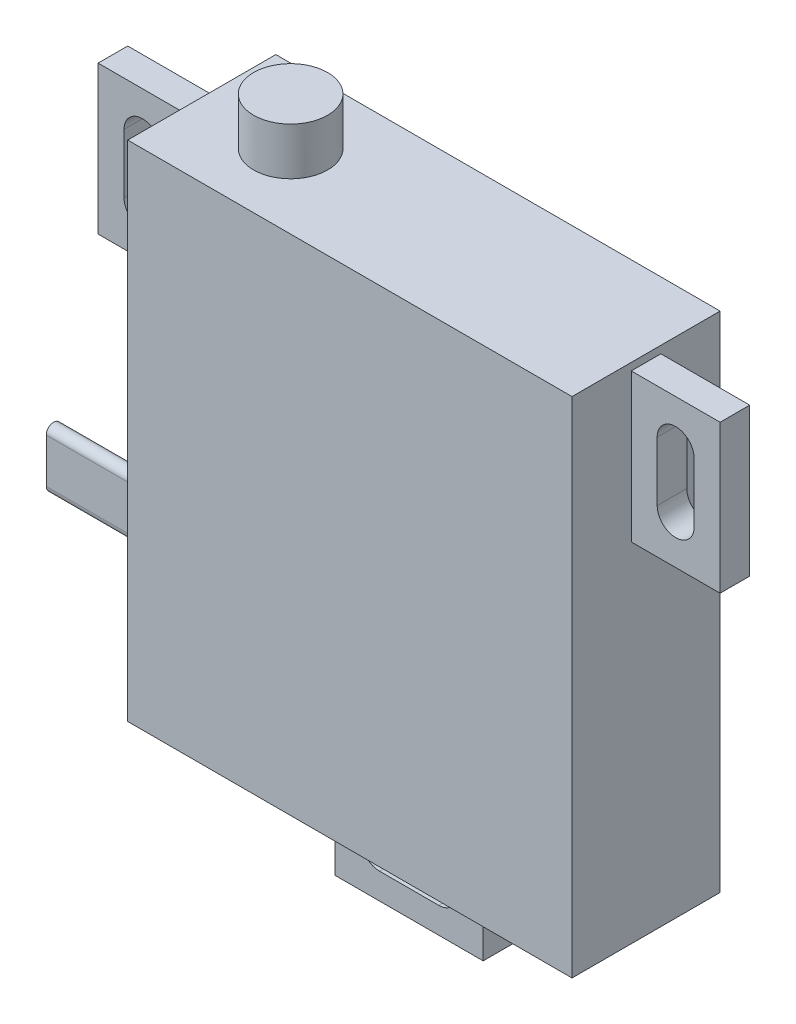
from build123d import *

# Parameters (mm, degrees)
ESQUISSE1_W      = 30
ESQUISSE1_H      = 34
EXTRUSION1_DEPTH = 5
ESQUISSE2_W      = 6
ESQUISSE2_H      = 10
ESQUISSE2_W_2    = 10
ESQUISSE2_H_2    = 6
EXTRUSION2_DEPTH = 1
EXTRUSION3_DEPTH = 10
ESQUISSE4_R      = 2.5
EXTRUSION4_DEPTH = 3.2


with BuildPart() as part:
    # Esquisse1 → Extrusion1 (new, symmetric)
    with BuildSketch(Plane.XY):
        with Locations((15, 17)):
            Rectangle(ESQUISSE1_W, ESQUISSE1_H)
    extrude(amount=EXTRUSION1_DEPTH, both=True)

    # Esquisse2 → Extrusion2 (add, symmetric)
    # profile 1 of 3: a face of its own
    with BuildSketch(Plane.XY):
        with Locations((33, 28.5)):
            Rectangle(ESQUISSE2_W, ESQUISSE2_H)
        with BuildLine():
            Line((31.75, 30.5), (31.75, 26.5))
            ThreePointArc((31.75, 26.5), (33, 25.25), (34.25, 26.5))
            Line((34.25, 26.5), (34.25, 30.5))
            ThreePointArc((34.25, 30.5), (33, 31.75), (31.75, 30.5))
        make_face(mode=Mode.SUBTRACT)
    # profile 2 of 3: a face of its own
    with BuildSketch(Plane.XY):
        with Locations((-3, 28.5)):
            Rectangle(ESQUISSE2_W, ESQUISSE2_H)
        with BuildLine():
            Line((-4.25, 30.5), (-4.25, 26.5))
            ThreePointArc((-4.25, 26.5), (-3, 25.25), (-1.75, 26.5))
            Line((-1.75, 26.5), (-1.75, 30.5))
            ThreePointArc((-1.75, 30.5), (-3, 31.75), (-4.25, 30.5))
        make_face(mode=Mode.SUBTRACT)
    # profile 3 of 3: a face of its own
    with BuildSketch(Plane.XY):
        with Locations((15, -3)):
            Rectangle(ESQUISSE2_W_2, ESQUISSE2_H_2)
        with BuildLine():
            Line((17, -1.75), (13, -1.75))
            ThreePointArc((13, -1.75), (11.75, -3), (13, -4.25))
            Line((13, -4.25), (17, -4.25))
            ThreePointArc((17, -4.25), (18.25, -3), (17, -1.75))
        make_face(mode=Mode.SUBTRACT)
    extrude(amount=EXTRUSION2_DEPTH, both=True)

    # Esquisse3 → Extrusion3 (add)
    with BuildSketch(Plane.ZY):
        with BuildLine():
            Line((-0.5, 6.5), (-0.5, 9.499999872))
            ThreePointArc((-0.5, 9.499999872), (-6.4e-08, 10), (0.5, 9.5))
            Line((0.5, 9.5), (0.5, 6.5))
            ThreePointArc((0.5, 6.5), (0, 6), (-0.5, 6.5))
        make_face()
    extrude(amount=EXTRUSION3_DEPTH)

    # Esquisse4 → Extrusion4 (add)
    with BuildSketch(Plane(origin=(0, 34, 0), x_dir=(1, 0, 0), z_dir=(0, 1, 0))):
        with Locations(Location((6, 0, 0), (0, 0, 90))):
            Circle(ESQUISSE4_R)
    extrude(amount=EXTRUSION4_DEPTH)


solid = part.part
